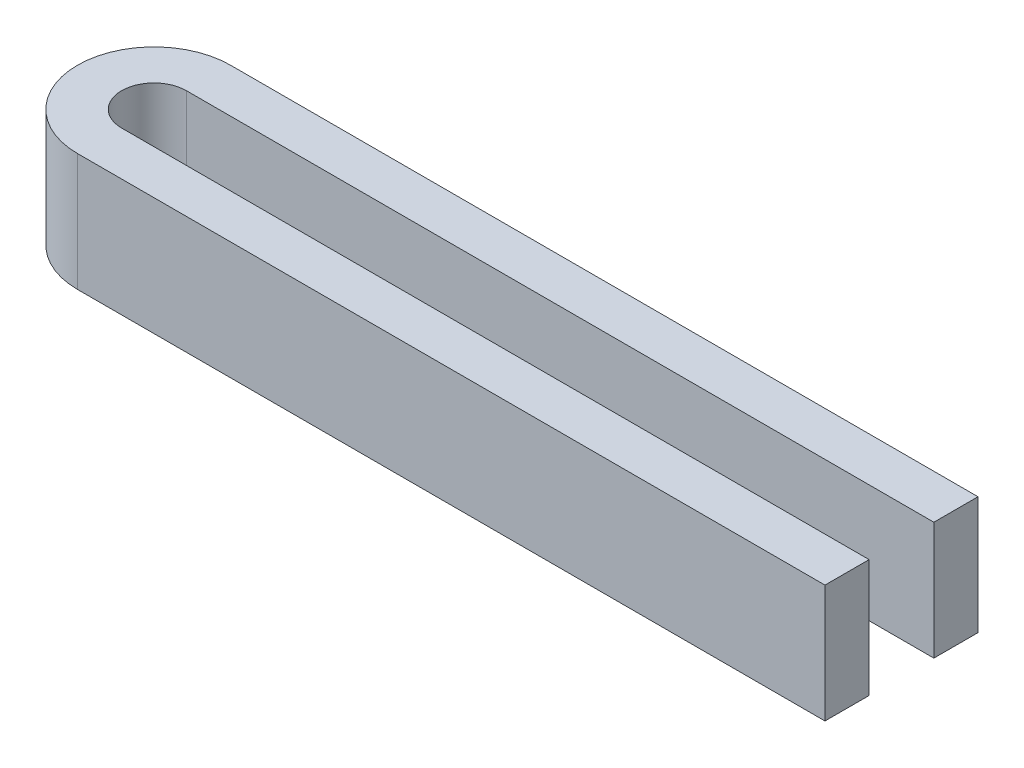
ISO-10303-21;
HEADER;
FILE_DESCRIPTION(('STEP AP214'),'2;1');
FILE_NAME('part.step','',(''),(''),'','','');
FILE_SCHEMA(('AUTOMOTIVE_DESIGN { 1 0 10303 214 1 1 1 1 }'));
ENDSEC;
DATA;
#1=APPLICATION_CONTEXT('core data for automotive mechanical design processes');
#2=APPLICATION_PROTOCOL_DEFINITION('international standard','automotive_design',2000,#1);
#3=PRODUCT_CONTEXT('',#1,'mechanical');
#4=PRODUCT('Part','Part','',(#3));
#5=PRODUCT_RELATED_PRODUCT_CATEGORY('part','',(#4));
#6=PRODUCT_DEFINITION_FORMATION('','',#4);
#7=PRODUCT_DEFINITION_CONTEXT('part definition',#1,'design');
#8=PRODUCT_DEFINITION('design','',#6,#7);
#9=PRODUCT_DEFINITION_SHAPE('','',#8);
#10=(LENGTH_UNIT() NAMED_UNIT(*) SI_UNIT(.MILLI.,.METRE.));
#11=(NAMED_UNIT(*) PLANE_ANGLE_UNIT() SI_UNIT($,.RADIAN.));
#12=(NAMED_UNIT(*) SI_UNIT($,.STERADIAN.) SOLID_ANGLE_UNIT());
#13=UNCERTAINTY_MEASURE_WITH_UNIT(LENGTH_MEASURE(1.E-05),#10,'distance_accuracy_value','');
#14=(GEOMETRIC_REPRESENTATION_CONTEXT(3) GLOBAL_UNCERTAINTY_ASSIGNED_CONTEXT((#13)) GLOBAL_UNIT_ASSIGNED_CONTEXT((#10,
#11,#12)) REPRESENTATION_CONTEXT('',''));
#15=CARTESIAN_POINT('',(0.,0.,0.));
#16=DIRECTION('',(0.,0.,1.));
#17=DIRECTION('',(1.,0.,0.));
#18=AXIS2_PLACEMENT_3D('',#15,#16,#17);
#19=CARTESIAN_POINT('',(254.,40.,-26.));
#20=DIRECTION('',(-1.,0.,0.));
#21=DIRECTION('',(0.,0.,1.));
#22=AXIS2_PLACEMENT_3D('',#19,#20,#21);
#23=PLANE('',#22);
#24=DIRECTION('',(0.,0.,-1.));
#25=VECTOR('',#24,1.);
#26=CARTESIAN_POINT('',(254.,0.,-26.));
#27=LINE('',#26,#25);
#28=CARTESIAN_POINT('',(254.,0.,-11.));
#29=VERTEX_POINT('',#28);
#30=CARTESIAN_POINT('',(254.,0.,-26.));
#31=VERTEX_POINT('',#30);
#32=EDGE_CURVE('E129',#29,#31,#27,.T.);
#33=ORIENTED_EDGE('',*,*,#32,.T.);
#34=DIRECTION('',(0.,-1.,0.));
#35=VECTOR('',#34,1.);
#36=CARTESIAN_POINT('',(254.,40.,-26.));
#37=LINE('',#36,#35);
#38=CARTESIAN_POINT('',(254.,40.,-26.));
#39=VERTEX_POINT('',#38);
#40=EDGE_CURVE('E11',#39,#31,#37,.T.);
#41=ORIENTED_EDGE('',*,*,#40,.F.);
#42=DIRECTION('',(0.,0.,-1.));
#43=VECTOR('',#42,1.);
#44=CARTESIAN_POINT('',(254.,40.,-26.));
#45=LINE('',#44,#43);
#46=CARTESIAN_POINT('',(254.,40.,-11.));
#47=VERTEX_POINT('',#46);
#48=EDGE_CURVE('E143',#47,#39,#45,.T.);
#49=ORIENTED_EDGE('',*,*,#48,.F.);
#50=DIRECTION('',(0.,-1.,0.));
#51=VECTOR('',#50,1.);
#52=CARTESIAN_POINT('',(254.,40.,-11.));
#53=LINE('',#52,#51);
#54=EDGE_CURVE('E125',#47,#29,#53,.T.);
#55=ORIENTED_EDGE('',*,*,#54,.T.);
#56=EDGE_LOOP('',(#33,#41,#49,#55));
#57=FACE_BOUND('',#56,.T.);
#58=ADVANCED_FACE('F33',(#57),#23,.F.);
#59=CARTESIAN_POINT('',(0.,40.,-26.));
#60=DIRECTION('',(0.,0.,1.));
#61=DIRECTION('',(1.,0.,0.));
#62=AXIS2_PLACEMENT_3D('',#59,#60,#61);
#63=PLANE('',#62);
#64=DIRECTION('',(-1.,0.,0.));
#65=VECTOR('',#64,1.);
#66=CARTESIAN_POINT('',(0.,0.,-26.));
#67=LINE('',#66,#65);
#68=CARTESIAN_POINT('',(0.,0.,-26.));
#69=VERTEX_POINT('',#68);
#70=EDGE_CURVE('E132',#31,#69,#67,.T.);
#71=ORIENTED_EDGE('',*,*,#70,.T.);
#72=DIRECTION('',(0.,-1.,0.));
#73=VECTOR('',#72,1.);
#74=CARTESIAN_POINT('',(0.,40.,-26.));
#75=LINE('',#74,#73);
#76=CARTESIAN_POINT('',(0.,40.,-26.));
#77=VERTEX_POINT('',#76);
#78=EDGE_CURVE('E41',#77,#69,#75,.T.);
#79=ORIENTED_EDGE('',*,*,#78,.F.);
#80=DIRECTION('',(-1.,0.,0.));
#81=VECTOR('',#80,1.);
#82=CARTESIAN_POINT('',(0.,40.,-26.));
#83=LINE('',#82,#81);
#84=EDGE_CURVE('E92',#39,#77,#83,.T.);
#85=ORIENTED_EDGE('',*,*,#84,.F.);
#86=ORIENTED_EDGE('',*,*,#40,.T.);
#87=EDGE_LOOP('',(#71,#79,#85,#86));
#88=FACE_BOUND('',#87,.T.);
#89=ADVANCED_FACE('F178',(#88),#63,.F.);
#90=CARTESIAN_POINT('',(0.,40.,0.));
#91=DIRECTION('',(0.,-1.,0.));
#92=DIRECTION('',(0.,0.,-1.));
#93=AXIS2_PLACEMENT_3D('',#90,#91,#92);
#94=CYLINDRICAL_SURFACE('',#93,26.);
#95=CARTESIAN_POINT('',(0.,0.,0.));
#96=DIRECTION('',(0.,1.,0.));
#97=DIRECTION('',(0.,0.,1.));
#98=AXIS2_PLACEMENT_3D('',#95,#96,#97);
#99=CIRCLE('',#98,26.);
#100=CARTESIAN_POINT('',(0.,0.,26.));
#101=VERTEX_POINT('',#100);
#102=EDGE_CURVE('E134',#69,#101,#99,.T.);
#103=ORIENTED_EDGE('',*,*,#102,.T.);
#104=DIRECTION('',(0.,-1.,0.));
#105=VECTOR('',#104,1.);
#106=CARTESIAN_POINT('',(0.,40.,26.));
#107=LINE('',#106,#105);
#108=CARTESIAN_POINT('',(0.,40.,26.));
#109=VERTEX_POINT('',#108);
#110=EDGE_CURVE('E150',#109,#101,#107,.T.);
#111=ORIENTED_EDGE('',*,*,#110,.F.);
#112=CARTESIAN_POINT('',(0.,40.,0.));
#113=DIRECTION('',(0.,1.,0.));
#114=DIRECTION('',(0.,0.,1.));
#115=AXIS2_PLACEMENT_3D('',#112,#113,#114);
#116=CIRCLE('',#115,26.);
#117=EDGE_CURVE('E158',#77,#109,#116,.T.);
#118=ORIENTED_EDGE('',*,*,#117,.F.);
#119=ORIENTED_EDGE('',*,*,#78,.T.);
#120=EDGE_LOOP('',(#103,#111,#118,#119));
#121=FACE_BOUND('',#120,.T.);
#122=ADVANCED_FACE('F156',(#121),#94,.T.);
#123=CARTESIAN_POINT('',(0.,40.,26.));
#124=DIRECTION('',(0.,0.,-1.));
#125=DIRECTION('',(-1.,0.,0.));
#126=AXIS2_PLACEMENT_3D('',#123,#124,#125);
#127=PLANE('',#126);
#128=DIRECTION('',(1.,0.,0.));
#129=VECTOR('',#128,1.);
#130=CARTESIAN_POINT('',(0.,0.,26.));
#131=LINE('',#130,#129);
#132=CARTESIAN_POINT('',(254.,0.,26.));
#133=VERTEX_POINT('',#132);
#134=EDGE_CURVE('E136',#101,#133,#131,.T.);
#135=ORIENTED_EDGE('',*,*,#134,.T.);
#136=DIRECTION('',(0.,-1.,0.));
#137=VECTOR('',#136,1.);
#138=CARTESIAN_POINT('',(254.,40.,26.));
#139=LINE('',#138,#137);
#140=CARTESIAN_POINT('',(254.,40.,26.));
#141=VERTEX_POINT('',#140);
#142=EDGE_CURVE('E147',#141,#133,#139,.T.);
#143=ORIENTED_EDGE('',*,*,#142,.F.);
#144=DIRECTION('',(1.,0.,0.));
#145=VECTOR('',#144,1.);
#146=CARTESIAN_POINT('',(0.,40.,26.));
#147=LINE('',#146,#145);
#148=EDGE_CURVE('E170',#109,#141,#147,.T.);
#149=ORIENTED_EDGE('',*,*,#148,.F.);
#150=ORIENTED_EDGE('',*,*,#110,.T.);
#151=EDGE_LOOP('',(#135,#143,#149,#150));
#152=FACE_BOUND('',#151,.T.);
#153=ADVANCED_FACE('F166',(#152),#127,.F.);
#154=CARTESIAN_POINT('',(254.,40.,26.));
#155=DIRECTION('',(-1.,0.,0.));
#156=DIRECTION('',(0.,0.,1.));
#157=AXIS2_PLACEMENT_3D('',#154,#155,#156);
#158=PLANE('',#157);
#159=DIRECTION('',(0.,0.,-1.));
#160=VECTOR('',#159,1.);
#161=CARTESIAN_POINT('',(254.,0.,26.));
#162=LINE('',#161,#160);
#163=CARTESIAN_POINT('',(254.,0.,11.));
#164=VERTEX_POINT('',#163);
#165=EDGE_CURVE('E138',#133,#164,#162,.T.);
#166=ORIENTED_EDGE('',*,*,#165,.T.);
#167=DIRECTION('',(0.,-1.,0.));
#168=VECTOR('',#167,1.);
#169=CARTESIAN_POINT('',(254.,40.,11.));
#170=LINE('',#169,#168);
#171=CARTESIAN_POINT('',(254.,40.,11.));
#172=VERTEX_POINT('',#171);
#173=EDGE_CURVE('E120',#172,#164,#170,.T.);
#174=ORIENTED_EDGE('',*,*,#173,.F.);
#175=DIRECTION('',(0.,0.,-1.));
#176=VECTOR('',#175,1.);
#177=CARTESIAN_POINT('',(254.,40.,26.));
#178=LINE('',#177,#176);
#179=EDGE_CURVE('E111',#141,#172,#178,.T.);
#180=ORIENTED_EDGE('',*,*,#179,.F.);
#181=ORIENTED_EDGE('',*,*,#142,.T.);
#182=EDGE_LOOP('',(#166,#174,#180,#181));
#183=FACE_BOUND('',#182,.T.);
#184=ADVANCED_FACE('F169',(#183),#158,.F.);
#185=CARTESIAN_POINT('',(254.,40.,11.));
#186=DIRECTION('',(0.,0.,1.));
#187=DIRECTION('',(1.,0.,0.));
#188=AXIS2_PLACEMENT_3D('',#185,#186,#187);
#189=PLANE('',#188);
#190=DIRECTION('',(-1.,0.,0.));
#191=VECTOR('',#190,1.);
#192=CARTESIAN_POINT('',(254.,0.,11.));
#193=LINE('',#192,#191);
#194=CARTESIAN_POINT('',(0.,0.,11.));
#195=VERTEX_POINT('',#194);
#196=EDGE_CURVE('E119',#164,#195,#193,.T.);
#197=ORIENTED_EDGE('',*,*,#196,.T.);
#198=DIRECTION('',(0.,-1.,0.));
#199=VECTOR('',#198,1.);
#200=CARTESIAN_POINT('',(0.,40.,11.));
#201=LINE('',#200,#199);
#202=CARTESIAN_POINT('',(0.,40.,11.));
#203=VERTEX_POINT('',#202);
#204=EDGE_CURVE('E116',#203,#195,#201,.T.);
#205=ORIENTED_EDGE('',*,*,#204,.F.);
#206=DIRECTION('',(-1.,0.,0.));
#207=VECTOR('',#206,1.);
#208=CARTESIAN_POINT('',(254.,40.,11.));
#209=LINE('',#208,#207);
#210=EDGE_CURVE('E105',#172,#203,#209,.T.);
#211=ORIENTED_EDGE('',*,*,#210,.F.);
#212=ORIENTED_EDGE('',*,*,#173,.T.);
#213=EDGE_LOOP('',(#197,#205,#211,#212));
#214=FACE_BOUND('',#213,.T.);
#215=ADVANCED_FACE('F117',(#214),#189,.F.);
#216=CARTESIAN_POINT('',(0.,40.,0.));
#217=DIRECTION('',(0.,-1.,0.));
#218=DIRECTION('',(0.,0.,-1.));
#219=AXIS2_PLACEMENT_3D('',#216,#217,#218);
#220=CYLINDRICAL_SURFACE('',#219,11.);
#221=CARTESIAN_POINT('',(0.,0.,0.));
#222=DIRECTION('',(0.,-1.,0.));
#223=DIRECTION('',(0.,0.,1.));
#224=AXIS2_PLACEMENT_3D('',#221,#222,#223);
#225=CIRCLE('',#224,11.);
#226=CARTESIAN_POINT('',(0.,0.,-11.));
#227=VERTEX_POINT('',#226);
#228=EDGE_CURVE('E78',#195,#227,#225,.T.);
#229=ORIENTED_EDGE('',*,*,#228,.T.);
#230=DIRECTION('',(0.,-1.,0.));
#231=VECTOR('',#230,1.);
#232=CARTESIAN_POINT('',(0.,40.,-11.));
#233=LINE('',#232,#231);
#234=CARTESIAN_POINT('',(0.,40.,-11.));
#235=VERTEX_POINT('',#234);
#236=EDGE_CURVE('E121',#235,#227,#233,.T.);
#237=ORIENTED_EDGE('',*,*,#236,.F.);
#238=CARTESIAN_POINT('',(0.,40.,0.));
#239=DIRECTION('',(0.,-1.,0.));
#240=DIRECTION('',(0.,0.,1.));
#241=AXIS2_PLACEMENT_3D('',#238,#239,#240);
#242=CIRCLE('',#241,11.);
#243=EDGE_CURVE('E109',#203,#235,#242,.T.);
#244=ORIENTED_EDGE('',*,*,#243,.F.);
#245=ORIENTED_EDGE('',*,*,#204,.T.);
#246=EDGE_LOOP('',(#229,#237,#244,#245));
#247=FACE_BOUND('',#246,.T.);
#248=ADVANCED_FACE('F123',(#247),#220,.F.);
#249=CARTESIAN_POINT('',(254.,40.,-11.));
#250=DIRECTION('',(0.,0.,-1.));
#251=DIRECTION('',(-1.,0.,0.));
#252=AXIS2_PLACEMENT_3D('',#249,#250,#251);
#253=PLANE('',#252);
#254=DIRECTION('',(1.,0.,0.));
#255=VECTOR('',#254,1.);
#256=CARTESIAN_POINT('',(254.,0.,-11.));
#257=LINE('',#256,#255);
#258=EDGE_CURVE('E84',#227,#29,#257,.T.);
#259=ORIENTED_EDGE('',*,*,#258,.T.);
#260=ORIENTED_EDGE('',*,*,#54,.F.);
#261=DIRECTION('',(1.,0.,0.));
#262=VECTOR('',#261,1.);
#263=CARTESIAN_POINT('',(254.,40.,-11.));
#264=LINE('',#263,#262);
#265=EDGE_CURVE('E49',#235,#47,#264,.T.);
#266=ORIENTED_EDGE('',*,*,#265,.F.);
#267=ORIENTED_EDGE('',*,*,#236,.T.);
#268=EDGE_LOOP('',(#259,#260,#266,#267));
#269=FACE_BOUND('',#268,.T.);
#270=ADVANCED_FACE('F194',(#269),#253,.F.);
#271=CARTESIAN_POINT('',(0.,40.,0.));
#272=DIRECTION('',(0.,1.,0.));
#273=DIRECTION('',(0.,0.,1.));
#274=AXIS2_PLACEMENT_3D('',#271,#272,#273);
#275=PLANE('',#274);
#276=ORIENTED_EDGE('',*,*,#48,.T.);
#277=ORIENTED_EDGE('',*,*,#84,.T.);
#278=ORIENTED_EDGE('',*,*,#117,.T.);
#279=ORIENTED_EDGE('',*,*,#148,.T.);
#280=ORIENTED_EDGE('',*,*,#179,.T.);
#281=ORIENTED_EDGE('',*,*,#210,.T.);
#282=ORIENTED_EDGE('',*,*,#243,.T.);
#283=ORIENTED_EDGE('',*,*,#265,.T.);
#284=EDGE_LOOP('',(#276,#277,#278,#279,#280,#281,#282,#283));
#285=FACE_BOUND('',#284,.T.);
#286=ADVANCED_FACE('F107',(#285),#275,.T.);
#287=CARTESIAN_POINT('',(0.,0.,0.));
#288=DIRECTION('',(0.,1.,0.));
#289=DIRECTION('',(0.,0.,1.));
#290=AXIS2_PLACEMENT_3D('',#287,#288,#289);
#291=PLANE('',#290);
#292=ORIENTED_EDGE('',*,*,#32,.F.);
#293=ORIENTED_EDGE('',*,*,#258,.F.);
#294=ORIENTED_EDGE('',*,*,#228,.F.);
#295=ORIENTED_EDGE('',*,*,#196,.F.);
#296=ORIENTED_EDGE('',*,*,#165,.F.);
#297=ORIENTED_EDGE('',*,*,#134,.F.);
#298=ORIENTED_EDGE('',*,*,#102,.F.);
#299=ORIENTED_EDGE('',*,*,#70,.F.);
#300=EDGE_LOOP('',(#292,#293,#294,#295,#296,#297,#298,#299));
#301=FACE_BOUND('',#300,.T.);
#302=ADVANCED_FACE('F162',(#301),#291,.F.);
#303=CLOSED_SHELL('',(#58,#89,#122,#153,#184,#215,#248,#270,#286,#302));
#304=MANIFOLD_SOLID_BREP('B2',#303);
#305=ADVANCED_BREP_SHAPE_REPRESENTATION('',(#18,#304),#14);
#306=SHAPE_DEFINITION_REPRESENTATION(#9,#305);
ENDSEC;
END-ISO-10303-21;
